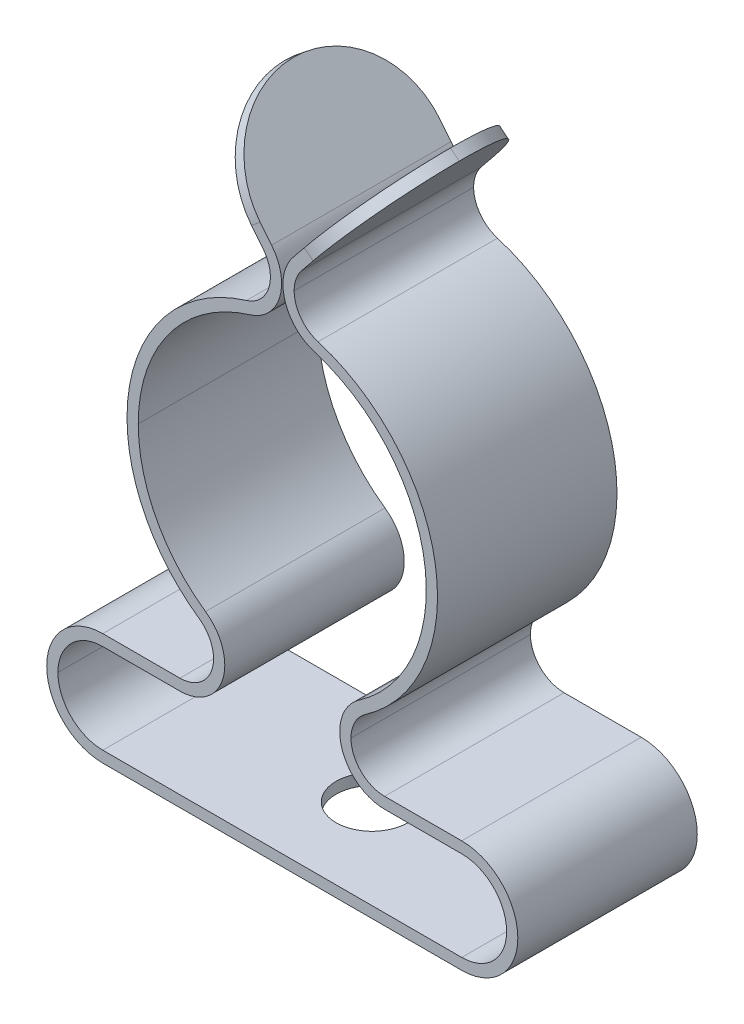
ISO-10303-21;
HEADER;
FILE_DESCRIPTION(('STEP AP214'),'2;1');
FILE_NAME('part.step','',(''),(''),'','','');
FILE_SCHEMA(('AUTOMOTIVE_DESIGN { 1 0 10303 214 1 1 1 1 }'));
ENDSEC;
DATA;
#1=APPLICATION_CONTEXT('core data for automotive mechanical design processes');
#2=APPLICATION_PROTOCOL_DEFINITION('international standard','automotive_design',2000,#1);
#3=PRODUCT_CONTEXT('',#1,'mechanical');
#4=PRODUCT('Part','Part','',(#3));
#5=PRODUCT_RELATED_PRODUCT_CATEGORY('part','',(#4));
#6=PRODUCT_DEFINITION_FORMATION('','',#4);
#7=PRODUCT_DEFINITION_CONTEXT('part definition',#1,'design');
#8=PRODUCT_DEFINITION('design','',#6,#7);
#9=PRODUCT_DEFINITION_SHAPE('','',#8);
#10=(LENGTH_UNIT() NAMED_UNIT(*) SI_UNIT(.MILLI.,.METRE.));
#11=(NAMED_UNIT(*) PLANE_ANGLE_UNIT() SI_UNIT($,.RADIAN.));
#12=(NAMED_UNIT(*) SI_UNIT($,.STERADIAN.) SOLID_ANGLE_UNIT());
#13=UNCERTAINTY_MEASURE_WITH_UNIT(LENGTH_MEASURE(1.E-05),#10,'distance_accuracy_value','');
#14=(GEOMETRIC_REPRESENTATION_CONTEXT(3) GLOBAL_UNCERTAINTY_ASSIGNED_CONTEXT((#13)) GLOBAL_UNIT_ASSIGNED_CONTEXT((#10,
#11,#12)) REPRESENTATION_CONTEXT('',''));
#15=CARTESIAN_POINT('',(0.,0.,0.));
#16=DIRECTION('',(0.,0.,1.));
#17=DIRECTION('',(1.,0.,0.));
#18=AXIS2_PLACEMENT_3D('',#15,#16,#17);
#19=CARTESIAN_POINT('',(2.54032362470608,22.6320461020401,0.));
#20=DIRECTION('',(0.77762314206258,-0.628730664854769,0.));
#21=DIRECTION('',(0.628730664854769,0.777623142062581,0.));
#22=AXIS2_PLACEMENT_3D('',#19,#20,#21);
#23=CYLINDRICAL_SURFACE('',#22,4.);
#24=CARTESIAN_POINT('',(0.985077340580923,23.8895074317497,0.));
#25=DIRECTION('',(-0.77762314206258,0.628730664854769,0.));
#26=DIRECTION('',(-0.628730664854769,-0.77762314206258,0.));
#27=AXIS2_PLACEMENT_3D('',#24,#25,#26);
#28=CIRCLE('',#27,4.);
#29=CARTESIAN_POINT('',(3.5,27.,0.));
#30=VERTEX_POINT('',#29);
#31=CARTESIAN_POINT('',(0.985077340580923,23.8895074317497,-4.));
#32=VERTEX_POINT('',#31);
#33=EDGE_CURVE('E482',#30,#32,#28,.T.);
#34=ORIENTED_EDGE('',*,*,#33,.F.);
#35=DIRECTION('',(0.777623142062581,-0.628730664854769,0.));
#36=VECTOR('',#35,1.);
#37=CARTESIAN_POINT('',(3.88881157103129,26.6856346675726,0.));
#38=LINE('',#37,#36);
#39=CARTESIAN_POINT('',(3.88881157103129,26.6856346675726,0.));
#40=VERTEX_POINT('',#39);
#41=EDGE_CURVE('E9',#30,#40,#38,.T.);
#42=ORIENTED_EDGE('',*,*,#41,.T.);
#43=CARTESIAN_POINT('',(1.37388891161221,23.5751420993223,0.));
#44=DIRECTION('',(0.77762314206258,-0.628730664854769,0.));
#45=DIRECTION('',(-0.628730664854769,-0.77762314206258,0.));
#46=AXIS2_PLACEMENT_3D('',#43,#44,#45);
#47=CIRCLE('',#46,4.);
#48=CARTESIAN_POINT('',(1.37388891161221,23.5751420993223,-4.));
#49=VERTEX_POINT('',#48);
#50=EDGE_CURVE('E467',#49,#40,#47,.T.);
#51=ORIENTED_EDGE('',*,*,#50,.F.);
#52=DIRECTION('',(0.777623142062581,-0.628730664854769,0.));
#53=VECTOR('',#52,1.);
#54=CARTESIAN_POINT('',(2.54032362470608,22.6320461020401,-4.));
#55=LINE('',#54,#53);
#56=EDGE_CURVE('E242',#32,#49,#55,.T.);
#57=ORIENTED_EDGE('',*,*,#56,.F.);
#58=EDGE_LOOP('',(#34,#42,#51,#57));
#59=FACE_BOUND('',#58,.T.);
#60=ADVANCED_FACE('F15',(#59),#23,.T.);
#61=CARTESIAN_POINT('',(0.985077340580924,23.8895074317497,0.));
#62=DIRECTION('',(-0.77762314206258,0.628730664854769,0.));
#63=DIRECTION('',(-0.628730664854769,-0.777623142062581,0.));
#64=AXIS2_PLACEMENT_3D('',#61,#62,#63);
#65=CYLINDRICAL_SURFACE('',#64,4.);
#66=ORIENTED_EDGE('',*,*,#41,.F.);
#67=CARTESIAN_POINT('',(0.985077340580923,23.8895074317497,0.));
#68=DIRECTION('',(-0.77762314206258,0.628730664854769,0.));
#69=DIRECTION('',(-0.628730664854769,-0.77762314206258,0.));
#70=AXIS2_PLACEMENT_3D('',#67,#68,#69);
#71=CIRCLE('',#70,4.);
#72=CARTESIAN_POINT('',(0.985077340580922,23.8895074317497,4.));
#73=VERTEX_POINT('',#72);
#74=EDGE_CURVE('E478',#73,#30,#71,.T.);
#75=ORIENTED_EDGE('',*,*,#74,.F.);
#76=DIRECTION('',(-0.777623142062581,0.628730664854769,0.));
#77=VECTOR('',#76,1.);
#78=CARTESIAN_POINT('',(0.985077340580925,23.8895074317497,4.));
#79=LINE('',#78,#77);
#80=CARTESIAN_POINT('',(1.37388891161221,23.5751420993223,4.));
#81=VERTEX_POINT('',#80);
#82=EDGE_CURVE('E153',#81,#73,#79,.T.);
#83=ORIENTED_EDGE('',*,*,#82,.F.);
#84=CARTESIAN_POINT('',(1.37388891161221,23.5751420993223,0.));
#85=DIRECTION('',(0.77762314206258,-0.628730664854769,0.));
#86=DIRECTION('',(-0.628730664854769,-0.77762314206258,0.));
#87=AXIS2_PLACEMENT_3D('',#84,#85,#86);
#88=CIRCLE('',#87,4.);
#89=EDGE_CURVE('E471',#40,#81,#88,.T.);
#90=ORIENTED_EDGE('',*,*,#89,.F.);
#91=EDGE_LOOP('',(#66,#75,#83,#90));
#92=FACE_BOUND('',#91,.T.);
#93=ADVANCED_FACE('F757',(#92),#65,.T.);
#94=CARTESIAN_POINT('',(-0.0861019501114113,24.6163548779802,0.));
#95=DIRECTION('',(0.77762314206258,0.628730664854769,0.));
#96=DIRECTION('',(-0.628730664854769,0.777623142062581,0.));
#97=AXIS2_PLACEMENT_3D('',#94,#95,#96);
#98=CYLINDRICAL_SURFACE('',#97,4.);
#99=CARTESIAN_POINT('',(-1.37388891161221,23.5751420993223,0.));
#100=DIRECTION('',(-0.77762314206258,-0.628730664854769,0.));
#101=DIRECTION('',(-0.628730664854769,0.77762314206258,0.));
#102=AXIS2_PLACEMENT_3D('',#99,#100,#101);
#103=CIRCLE('',#102,4.);
#104=CARTESIAN_POINT('',(-3.88881157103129,26.6856346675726,0.));
#105=VERTEX_POINT('',#104);
#106=CARTESIAN_POINT('',(-1.37388891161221,23.5751420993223,-4.));
#107=VERTEX_POINT('',#106);
#108=EDGE_CURVE('E186',#105,#107,#103,.T.);
#109=ORIENTED_EDGE('',*,*,#108,.F.);
#110=DIRECTION('',(0.777623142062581,0.628730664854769,0.));
#111=VECTOR('',#110,1.);
#112=CARTESIAN_POINT('',(-3.5,27.,0.));
#113=LINE('',#112,#111);
#114=CARTESIAN_POINT('',(-3.5,27.,0.));
#115=VERTEX_POINT('',#114);
#116=EDGE_CURVE('E23',#105,#115,#113,.T.);
#117=ORIENTED_EDGE('',*,*,#116,.T.);
#118=CARTESIAN_POINT('',(-0.985077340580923,23.8895074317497,0.));
#119=DIRECTION('',(0.77762314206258,0.628730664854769,0.));
#120=DIRECTION('',(-0.628730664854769,0.77762314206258,0.));
#121=AXIS2_PLACEMENT_3D('',#118,#119,#120);
#122=CIRCLE('',#121,4.);
#123=CARTESIAN_POINT('',(-0.985077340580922,23.8895074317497,-4.));
#124=VERTEX_POINT('',#123);
#125=EDGE_CURVE('E168',#124,#115,#122,.T.);
#126=ORIENTED_EDGE('',*,*,#125,.F.);
#127=DIRECTION('',(0.777623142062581,0.628730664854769,0.));
#128=VECTOR('',#127,1.);
#129=CARTESIAN_POINT('',(-0.0861019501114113,24.6163548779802,-4.));
#130=LINE('',#129,#128);
#131=EDGE_CURVE('E240',#107,#124,#130,.T.);
#132=ORIENTED_EDGE('',*,*,#131,.F.);
#133=EDGE_LOOP('',(#109,#117,#126,#132));
#134=FACE_BOUND('',#133,.T.);
#135=ADVANCED_FACE('F762',(#134),#98,.T.);
#136=CARTESIAN_POINT('',(-1.37388891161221,23.5751420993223,0.));
#137=DIRECTION('',(-0.77762314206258,-0.628730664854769,0.));
#138=DIRECTION('',(0.628730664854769,-0.777623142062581,0.));
#139=AXIS2_PLACEMENT_3D('',#136,#137,#138);
#140=CYLINDRICAL_SURFACE('',#139,4.);
#141=ORIENTED_EDGE('',*,*,#116,.F.);
#142=CARTESIAN_POINT('',(-1.37388891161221,23.5751420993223,0.));
#143=DIRECTION('',(-0.77762314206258,-0.628730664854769,0.));
#144=DIRECTION('',(-0.628730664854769,0.77762314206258,0.));
#145=AXIS2_PLACEMENT_3D('',#142,#143,#144);
#146=CIRCLE('',#145,4.);
#147=CARTESIAN_POINT('',(-1.37388891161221,23.5751420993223,4.));
#148=VERTEX_POINT('',#147);
#149=EDGE_CURVE('E148',#148,#105,#146,.T.);
#150=ORIENTED_EDGE('',*,*,#149,.F.);
#151=DIRECTION('',(-0.777623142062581,-0.628730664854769,0.));
#152=VECTOR('',#151,1.);
#153=CARTESIAN_POINT('',(-1.37388891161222,23.5751420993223,4.));
#154=LINE('',#153,#152);
#155=CARTESIAN_POINT('',(-0.985077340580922,23.8895074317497,4.));
#156=VERTEX_POINT('',#155);
#157=EDGE_CURVE('E141',#156,#148,#154,.T.);
#158=ORIENTED_EDGE('',*,*,#157,.F.);
#159=CARTESIAN_POINT('',(-0.985077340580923,23.8895074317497,0.));
#160=DIRECTION('',(0.77762314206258,0.628730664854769,0.));
#161=DIRECTION('',(-0.628730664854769,0.77762314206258,0.));
#162=AXIS2_PLACEMENT_3D('',#159,#160,#161);
#163=CIRCLE('',#162,4.);
#164=EDGE_CURVE('E145',#115,#156,#163,.T.);
#165=ORIENTED_EDGE('',*,*,#164,.F.);
#166=EDGE_LOOP('',(#141,#150,#158,#165));
#167=FACE_BOUND('',#166,.T.);
#168=ADVANCED_FACE('F143',(#167),#140,.T.);
#169=CARTESIAN_POINT('',(0.,4.5254833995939,0.));
#170=DIRECTION('',(0.,-1.,0.));
#171=DIRECTION('',(0.,0.,-1.));
#172=AXIS2_PLACEMENT_3D('',#169,#170,#171);
#173=CYLINDRICAL_SURFACE('',#172,1.6);
#174=DIRECTION('',(0.,-1.,0.));
#175=VECTOR('',#174,1.);
#176=CARTESIAN_POINT('',(0.,4.5254833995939,1.6));
#177=LINE('',#176,#175);
#178=CARTESIAN_POINT('',(0.,0.,1.6));
#179=VERTEX_POINT('',#178);
#180=CARTESIAN_POINT('',(0.,-0.5,1.6));
#181=VERTEX_POINT('',#180);
#182=EDGE_CURVE('E898',#179,#181,#177,.T.);
#183=ORIENTED_EDGE('',*,*,#182,.F.);
#184=CARTESIAN_POINT('',(0.,0.,0.));
#185=DIRECTION('',(0.,-1.,0.));
#186=DIRECTION('',(0.,0.,1.));
#187=AXIS2_PLACEMENT_3D('',#184,#185,#186);
#188=CIRCLE('',#187,1.6);
#189=CARTESIAN_POINT('',(0.,0.,-1.6));
#190=VERTEX_POINT('',#189);
#191=EDGE_CURVE('E274',#190,#179,#188,.T.);
#192=ORIENTED_EDGE('',*,*,#191,.F.);
#193=DIRECTION('',(0.,-1.,0.));
#194=VECTOR('',#193,1.);
#195=CARTESIAN_POINT('',(0.,4.5254833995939,-1.6));
#196=LINE('',#195,#194);
#197=CARTESIAN_POINT('',(0.,-0.5,-1.6));
#198=VERTEX_POINT('',#197);
#199=EDGE_CURVE('E817',#190,#198,#196,.T.);
#200=ORIENTED_EDGE('',*,*,#199,.T.);
#201=CARTESIAN_POINT('',(0.,-0.5,0.));
#202=DIRECTION('',(0.,-1.,0.));
#203=DIRECTION('',(0.,0.,-1.));
#204=AXIS2_PLACEMENT_3D('',#201,#202,#203);
#205=CIRCLE('',#204,1.6);
#206=EDGE_CURVE('E216',#198,#181,#205,.T.);
#207=ORIENTED_EDGE('',*,*,#206,.T.);
#208=EDGE_LOOP('',(#183,#192,#200,#207));
#209=FACE_BOUND('',#208,.T.);
#210=ADVANCED_FACE('F955',(#209),#173,.F.);
#211=CARTESIAN_POINT('',(2.02929618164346,22.,-4.));
#212=DIRECTION('',(0.,0.,-1.));
#213=DIRECTION('',(0.,-1.,0.));
#214=AXIS2_PLACEMENT_3D('',#211,#212,#213);
#215=PLANE('',#214);
#216=DIRECTION('',(0.62873066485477,-0.77762314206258,0.));
#217=VECTOR('',#216,1.);
#218=CARTESIAN_POINT('',(-0.862861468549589,22.9430959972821,-4.));
#219=LINE('',#218,#217);
#220=CARTESIAN_POINT('',(-0.862861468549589,22.9430959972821,-4.));
#221=VERTEX_POINT('',#220);
#222=EDGE_CURVE('E187',#107,#221,#219,.T.);
#223=ORIENTED_EDGE('',*,*,#222,.F.);
#224=ORIENTED_EDGE('',*,*,#131,.T.);
#225=DIRECTION('',(0.628730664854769,-0.77762314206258,0.));
#226=VECTOR('',#225,1.);
#227=CARTESIAN_POINT('',(-0.474049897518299,23.2574613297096,-4.));
#228=LINE('',#227,#226);
#229=CARTESIAN_POINT('',(-0.474049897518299,23.2574613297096,-4.));
#230=VERTEX_POINT('',#229);
#231=EDGE_CURVE('E175',#124,#230,#228,.T.);
#232=ORIENTED_EDGE('',*,*,#231,.T.);
#233=CARTESIAN_POINT('',(-2.02929618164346,22.,-4.));
#234=DIRECTION('',(0.,0.,-1.));
#235=DIRECTION('',(1.,0.,0.));
#236=AXIS2_PLACEMENT_3D('',#233,#234,#235);
#237=CIRCLE('',#236,2.);
#238=CARTESIAN_POINT('',(-1.44956711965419,20.08586463,-4.));
#239=VERTEX_POINT('',#238);
#240=EDGE_CURVE('E331',#230,#239,#237,.T.);
#241=ORIENTED_EDGE('',*,*,#240,.T.);
#242=CARTESIAN_POINT('',(0.57948459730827,13.386390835,-4.));
#243=DIRECTION('',(0.,0.,1.));
#244=DIRECTION('',(-1.,0.,0.));
#245=AXIS2_PLACEMENT_3D('',#242,#243,#244);
#246=CIRCLE('',#245,7.);
#247=CARTESIAN_POINT('',(-6.42051540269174,13.386390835,-4.));
#248=VERTEX_POINT('',#247);
#249=EDGE_CURVE('E392',#239,#248,#246,.T.);
#250=ORIENTED_EDGE('',*,*,#249,.T.);
#251=CARTESIAN_POINT('',(0.57948459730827,13.386390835,-4.));
#252=DIRECTION('',(0.,0.,1.));
#253=DIRECTION('',(-1.,0.,0.));
#254=AXIS2_PLACEMENT_3D('',#251,#252,#253);
#255=CIRCLE('',#254,7.);
#256=CARTESIAN_POINT('',(-3.41992938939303,7.64142018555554,-4.));
#257=VERTEX_POINT('',#256);
#258=EDGE_CURVE('E327',#248,#257,#255,.T.);
#259=ORIENTED_EDGE('',*,*,#258,.T.);
#260=CARTESIAN_POINT('',(-4.56261909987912,6.,-4.));
#261=DIRECTION('',(0.,0.,-1.));
#262=DIRECTION('',(1.,0.,0.));
#263=AXIS2_PLACEMENT_3D('',#260,#261,#262);
#264=CIRCLE('',#263,2.);
#265=CARTESIAN_POINT('',(-4.56261909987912,4.,-4.));
#266=VERTEX_POINT('',#265);
#267=EDGE_CURVE('E307',#257,#266,#264,.T.);
#268=ORIENTED_EDGE('',*,*,#267,.T.);
#269=DIRECTION('',(-1.,0.,0.));
#270=VECTOR('',#269,1.);
#271=CARTESIAN_POINT('',(-8.,4.,-4.));
#272=LINE('',#271,#270);
#273=CARTESIAN_POINT('',(-8.,4.,-4.));
#274=VERTEX_POINT('',#273);
#275=EDGE_CURVE('E290',#266,#274,#272,.T.);
#276=ORIENTED_EDGE('',*,*,#275,.T.);
#277=CARTESIAN_POINT('',(-8.,2.,-4.));
#278=DIRECTION('',(0.,0.,1.));
#279=DIRECTION('',(-1.,0.,0.));
#280=AXIS2_PLACEMENT_3D('',#277,#278,#279);
#281=CIRCLE('',#280,2.);
#282=CARTESIAN_POINT('',(-10.,2.,-4.));
#283=VERTEX_POINT('',#282);
#284=EDGE_CURVE('E413',#274,#283,#281,.T.);
#285=ORIENTED_EDGE('',*,*,#284,.T.);
#286=CARTESIAN_POINT('',(-8.,2.,-4.));
#287=DIRECTION('',(0.,0.,1.));
#288=DIRECTION('',(-1.,0.,0.));
#289=AXIS2_PLACEMENT_3D('',#286,#287,#288);
#290=CIRCLE('',#289,2.);
#291=CARTESIAN_POINT('',(-8.,0.,-4.));
#292=VERTEX_POINT('',#291);
#293=EDGE_CURVE('E285',#283,#292,#290,.T.);
#294=ORIENTED_EDGE('',*,*,#293,.T.);
#295=DIRECTION('',(1.,0.,0.));
#296=VECTOR('',#295,1.);
#297=CARTESIAN_POINT('',(-8.,0.,-4.));
#298=LINE('',#297,#296);
#299=CARTESIAN_POINT('',(8.,0.,-4.));
#300=VERTEX_POINT('',#299);
#301=EDGE_CURVE('E263',#292,#300,#298,.T.);
#302=ORIENTED_EDGE('',*,*,#301,.T.);
#303=CARTESIAN_POINT('',(8.,2.,-4.));
#304=DIRECTION('',(0.,0.,1.));
#305=DIRECTION('',(1.,0.,0.));
#306=AXIS2_PLACEMENT_3D('',#303,#304,#305);
#307=CIRCLE('',#306,2.);
#308=CARTESIAN_POINT('',(8.,4.,-4.));
#309=VERTEX_POINT('',#308);
#310=EDGE_CURVE('E529',#300,#309,#307,.T.);
#311=ORIENTED_EDGE('',*,*,#310,.T.);
#312=DIRECTION('',(-1.,0.,0.));
#313=VECTOR('',#312,1.);
#314=CARTESIAN_POINT('',(8.,4.,-4.));
#315=LINE('',#314,#313);
#316=CARTESIAN_POINT('',(4.56261909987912,4.,-4.));
#317=VERTEX_POINT('',#316);
#318=EDGE_CURVE('E517',#309,#317,#315,.T.);
#319=ORIENTED_EDGE('',*,*,#318,.T.);
#320=CARTESIAN_POINT('',(4.56261909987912,6.,-4.));
#321=DIRECTION('',(0.,0.,-1.));
#322=DIRECTION('',(-1.,0.,0.));
#323=AXIS2_PLACEMENT_3D('',#320,#321,#322);
#324=CIRCLE('',#323,2.);
#325=CARTESIAN_POINT('',(2.56261909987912,6.,-4.));
#326=VERTEX_POINT('',#325);
#327=EDGE_CURVE('E436',#317,#326,#324,.T.);
#328=ORIENTED_EDGE('',*,*,#327,.T.);
#329=CARTESIAN_POINT('',(4.56261909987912,6.,-4.));
#330=DIRECTION('',(0.,0.,-1.));
#331=DIRECTION('',(-1.,0.,0.));
#332=AXIS2_PLACEMENT_3D('',#329,#330,#331);
#333=CIRCLE('',#332,2.);
#334=CARTESIAN_POINT('',(3.41992938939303,7.64142018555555,-4.));
#335=VERTEX_POINT('',#334);
#336=EDGE_CURVE('E513',#326,#335,#333,.T.);
#337=ORIENTED_EDGE('',*,*,#336,.T.);
#338=CARTESIAN_POINT('',(-0.57948459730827,13.386390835,-4.));
#339=DIRECTION('',(0.,0.,1.));
#340=DIRECTION('',(1.,0.,0.));
#341=AXIS2_PLACEMENT_3D('',#338,#339,#340);
#342=CIRCLE('',#341,7.);
#343=CARTESIAN_POINT('',(1.44956711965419,20.08586463,-4.));
#344=VERTEX_POINT('',#343);
#345=EDGE_CURVE('E359',#335,#344,#342,.T.);
#346=ORIENTED_EDGE('',*,*,#345,.T.);
#347=CARTESIAN_POINT('',(2.02929618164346,22.,-4.));
#348=DIRECTION('',(0.,0.,-1.));
#349=DIRECTION('',(-1.,0.,0.));
#350=AXIS2_PLACEMENT_3D('',#347,#348,#349);
#351=CIRCLE('',#350,2.);
#352=CARTESIAN_POINT('',(0.0292961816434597,22.,-4.));
#353=VERTEX_POINT('',#352);
#354=EDGE_CURVE('E455',#344,#353,#351,.T.);
#355=ORIENTED_EDGE('',*,*,#354,.T.);
#356=CARTESIAN_POINT('',(2.02929618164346,22.,-4.));
#357=DIRECTION('',(0.,0.,-1.));
#358=DIRECTION('',(-1.,0.,0.));
#359=AXIS2_PLACEMENT_3D('',#356,#357,#358);
#360=CIRCLE('',#359,2.);
#361=CARTESIAN_POINT('',(0.4740498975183,23.2574613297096,-4.));
#362=VERTEX_POINT('',#361);
#363=EDGE_CURVE('E364',#353,#362,#360,.T.);
#364=ORIENTED_EDGE('',*,*,#363,.T.);
#365=DIRECTION('',(0.628730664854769,0.77762314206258,0.));
#366=VECTOR('',#365,1.);
#367=CARTESIAN_POINT('',(0.474049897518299,23.2574613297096,-4.));
#368=LINE('',#367,#366);
#369=EDGE_CURVE('E488',#362,#32,#368,.T.);
#370=ORIENTED_EDGE('',*,*,#369,.T.);
#371=ORIENTED_EDGE('',*,*,#56,.T.);
#372=DIRECTION('',(0.62873066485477,0.77762314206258,0.));
#373=VECTOR('',#372,1.);
#374=CARTESIAN_POINT('',(0.862861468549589,22.9430959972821,-4.));
#375=LINE('',#374,#373);
#376=CARTESIAN_POINT('',(0.862861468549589,22.9430959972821,-4.));
#377=VERTEX_POINT('',#376);
#378=EDGE_CURVE('E463',#377,#49,#375,.T.);
#379=ORIENTED_EDGE('',*,*,#378,.F.);
#380=CARTESIAN_POINT('',(2.02929618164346,22.,-4.));
#381=DIRECTION('',(0.,0.,-1.));
#382=DIRECTION('',(1.,0.,0.));
#383=AXIS2_PLACEMENT_3D('',#380,#381,#382);
#384=CIRCLE('',#383,1.5);
#385=CARTESIAN_POINT('',(0.52929618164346,22.,-4.));
#386=VERTEX_POINT('',#385);
#387=EDGE_CURVE('E779',#386,#377,#384,.T.);
#388=ORIENTED_EDGE('',*,*,#387,.F.);
#389=CARTESIAN_POINT('',(2.02929618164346,22.,-4.));
#390=DIRECTION('',(0.,0.,-1.));
#391=DIRECTION('',(1.,0.,0.));
#392=AXIS2_PLACEMENT_3D('',#389,#390,#391);
#393=CIRCLE('',#392,1.5);
#394=CARTESIAN_POINT('',(1.59449938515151,20.5643984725,-4.));
#395=VERTEX_POINT('',#394);
#396=EDGE_CURVE('E47',#395,#386,#393,.T.);
#397=ORIENTED_EDGE('',*,*,#396,.F.);
#398=CARTESIAN_POINT('',(-0.57948459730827,13.386390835,-4.));
#399=DIRECTION('',(0.,0.,1.));
#400=DIRECTION('',(1.,0.,0.));
#401=AXIS2_PLACEMENT_3D('',#398,#399,#400);
#402=CIRCLE('',#401,7.5);
#403=CARTESIAN_POINT('',(3.70560181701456,7.23106513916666,-4.));
#404=VERTEX_POINT('',#403);
#405=EDGE_CURVE('E180',#404,#395,#402,.T.);
#406=ORIENTED_EDGE('',*,*,#405,.F.);
#407=CARTESIAN_POINT('',(4.56261909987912,6.,-4.));
#408=DIRECTION('',(0.,0.,-1.));
#409=DIRECTION('',(1.,0.,0.));
#410=AXIS2_PLACEMENT_3D('',#407,#408,#409);
#411=CIRCLE('',#410,1.5);
#412=CARTESIAN_POINT('',(3.06261909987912,6.,-4.));
#413=VERTEX_POINT('',#412);
#414=EDGE_CURVE('E854',#413,#404,#411,.T.);
#415=ORIENTED_EDGE('',*,*,#414,.F.);
#416=CARTESIAN_POINT('',(4.56261909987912,6.,-4.));
#417=DIRECTION('',(0.,0.,-1.));
#418=DIRECTION('',(1.,0.,0.));
#419=AXIS2_PLACEMENT_3D('',#416,#417,#418);
#420=CIRCLE('',#419,1.5);
#421=CARTESIAN_POINT('',(4.56261909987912,4.5,-4.));
#422=VERTEX_POINT('',#421);
#423=EDGE_CURVE('E100',#422,#413,#420,.T.);
#424=ORIENTED_EDGE('',*,*,#423,.F.);
#425=DIRECTION('',(-1.,0.,0.));
#426=VECTOR('',#425,1.);
#427=CARTESIAN_POINT('',(8.,4.5,-4.));
#428=LINE('',#427,#426);
#429=CARTESIAN_POINT('',(8.,4.5,-4.));
#430=VERTEX_POINT('',#429);
#431=EDGE_CURVE('E226',#430,#422,#428,.T.);
#432=ORIENTED_EDGE('',*,*,#431,.F.);
#433=CARTESIAN_POINT('',(8.,2.,-4.));
#434=DIRECTION('',(0.,0.,1.));
#435=DIRECTION('',(1.,0.,0.));
#436=AXIS2_PLACEMENT_3D('',#433,#434,#435);
#437=CIRCLE('',#436,2.5);
#438=CARTESIAN_POINT('',(8.,-0.5,-4.));
#439=VERTEX_POINT('',#438);
#440=EDGE_CURVE('E220',#439,#430,#437,.T.);
#441=ORIENTED_EDGE('',*,*,#440,.F.);
#442=DIRECTION('',(1.,0.,0.));
#443=VECTOR('',#442,1.);
#444=CARTESIAN_POINT('',(-8.,-0.5,-4.));
#445=LINE('',#444,#443);
#446=CARTESIAN_POINT('',(-8.,-0.5,-4.));
#447=VERTEX_POINT('',#446);
#448=EDGE_CURVE('E303',#447,#439,#445,.T.);
#449=ORIENTED_EDGE('',*,*,#448,.F.);
#450=CARTESIAN_POINT('',(-8.,2.,-4.));
#451=DIRECTION('',(0.,0.,1.));
#452=DIRECTION('',(1.,0.,0.));
#453=AXIS2_PLACEMENT_3D('',#450,#451,#452);
#454=CIRCLE('',#453,2.5);
#455=CARTESIAN_POINT('',(-10.5,2.,-4.));
#456=VERTEX_POINT('',#455);
#457=EDGE_CURVE('E835',#456,#447,#454,.T.);
#458=ORIENTED_EDGE('',*,*,#457,.F.);
#459=CARTESIAN_POINT('',(-8.,2.,-4.));
#460=DIRECTION('',(0.,0.,1.));
#461=DIRECTION('',(1.,0.,0.));
#462=AXIS2_PLACEMENT_3D('',#459,#460,#461);
#463=CIRCLE('',#462,2.5);
#464=CARTESIAN_POINT('',(-8.,4.5,-4.));
#465=VERTEX_POINT('',#464);
#466=EDGE_CURVE('E299',#465,#456,#463,.T.);
#467=ORIENTED_EDGE('',*,*,#466,.F.);
#468=DIRECTION('',(-1.,0.,0.));
#469=VECTOR('',#468,1.);
#470=CARTESIAN_POINT('',(-8.,4.5,-4.));
#471=LINE('',#470,#469);
#472=CARTESIAN_POINT('',(-4.56261909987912,4.5,-4.));
#473=VERTEX_POINT('',#472);
#474=EDGE_CURVE('E210',#473,#465,#471,.T.);
#475=ORIENTED_EDGE('',*,*,#474,.F.);
#476=CARTESIAN_POINT('',(-4.56261909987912,6.,-4.));
#477=DIRECTION('',(0.,0.,-1.));
#478=DIRECTION('',(1.,0.,0.));
#479=AXIS2_PLACEMENT_3D('',#476,#477,#478);
#480=CIRCLE('',#479,1.5);
#481=CARTESIAN_POINT('',(-3.70560181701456,7.23106513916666,-4.));
#482=VERTEX_POINT('',#481);
#483=EDGE_CURVE('E201',#482,#473,#480,.T.);
#484=ORIENTED_EDGE('',*,*,#483,.F.);
#485=CARTESIAN_POINT('',(0.57948459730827,13.386390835,-4.));
#486=DIRECTION('',(0.,0.,1.));
#487=DIRECTION('',(1.,0.,0.));
#488=AXIS2_PLACEMENT_3D('',#485,#486,#487);
#489=CIRCLE('',#488,7.5);
#490=CARTESIAN_POINT('',(-6.92051540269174,13.386390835,-4.));
#491=VERTEX_POINT('',#490);
#492=EDGE_CURVE('E358',#491,#482,#489,.T.);
#493=ORIENTED_EDGE('',*,*,#492,.F.);
#494=CARTESIAN_POINT('',(0.57948459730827,13.386390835,-4.));
#495=DIRECTION('',(0.,0.,1.));
#496=DIRECTION('',(1.,0.,0.));
#497=AXIS2_PLACEMENT_3D('',#494,#495,#496);
#498=CIRCLE('',#497,7.5);
#499=CARTESIAN_POINT('',(-1.59449938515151,20.5643984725,-4.));
#500=VERTEX_POINT('',#499);
#501=EDGE_CURVE('E196',#500,#491,#498,.T.);
#502=ORIENTED_EDGE('',*,*,#501,.F.);
#503=CARTESIAN_POINT('',(-2.02929618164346,22.,-4.));
#504=DIRECTION('',(0.,0.,-1.));
#505=DIRECTION('',(1.,0.,0.));
#506=AXIS2_PLACEMENT_3D('',#503,#504,#505);
#507=CIRCLE('',#506,1.5);
#508=EDGE_CURVE('E395',#221,#500,#507,.T.);
#509=ORIENTED_EDGE('',*,*,#508,.F.);
#510=EDGE_LOOP('',(#223,#224,#232,#241,#250,#259,#268,#276,#285,#294,#302,#311,#319,#328,#337,
#346,#355,#364,#370,#371,#379,#388,#397,#406,#415,#424,#432,#441,#449,#458,#467,#475,#484,#493,
#502,#509));
#511=FACE_BOUND('',#510,.T.);
#512=ADVANCED_FACE('F566',(#511),#215,.T.);
#513=CARTESIAN_POINT('',(2.02929618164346,22.,4.));
#514=DIRECTION('',(0.,0.,-1.));
#515=DIRECTION('',(0.,-1.,0.));
#516=AXIS2_PLACEMENT_3D('',#513,#514,#515);
#517=PLANE('',#516);
#518=DIRECTION('',(0.628730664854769,-0.77762314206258,0.));
#519=VECTOR('',#518,1.);
#520=CARTESIAN_POINT('',(-0.474049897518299,23.2574613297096,4.));
#521=LINE('',#520,#519);
#522=CARTESIAN_POINT('',(-0.474049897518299,23.2574613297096,4.));
#523=VERTEX_POINT('',#522);
#524=EDGE_CURVE('E156',#156,#523,#521,.T.);
#525=ORIENTED_EDGE('',*,*,#524,.F.);
#526=ORIENTED_EDGE('',*,*,#157,.T.);
#527=DIRECTION('',(0.62873066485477,-0.77762314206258,0.));
#528=VECTOR('',#527,1.);
#529=CARTESIAN_POINT('',(-0.862861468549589,22.9430959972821,4.));
#530=LINE('',#529,#528);
#531=CARTESIAN_POINT('',(-0.862861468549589,22.9430959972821,4.));
#532=VERTEX_POINT('',#531);
#533=EDGE_CURVE('E388',#148,#532,#530,.T.);
#534=ORIENTED_EDGE('',*,*,#533,.T.);
#535=CARTESIAN_POINT('',(-2.02929618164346,22.,4.));
#536=DIRECTION('',(0.,0.,-1.));
#537=DIRECTION('',(1.,0.,0.));
#538=AXIS2_PLACEMENT_3D('',#535,#536,#537);
#539=CIRCLE('',#538,1.5);
#540=CARTESIAN_POINT('',(-1.59449938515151,20.5643984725,4.));
#541=VERTEX_POINT('',#540);
#542=EDGE_CURVE('E197',#532,#541,#539,.T.);
#543=ORIENTED_EDGE('',*,*,#542,.T.);
#544=CARTESIAN_POINT('',(0.57948459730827,13.386390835,4.));
#545=DIRECTION('',(0.,0.,1.));
#546=DIRECTION('',(1.,0.,0.));
#547=AXIS2_PLACEMENT_3D('',#544,#545,#546);
#548=CIRCLE('',#547,7.5);
#549=CARTESIAN_POINT('',(-6.92051540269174,13.386390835,4.));
#550=VERTEX_POINT('',#549);
#551=EDGE_CURVE('E192',#541,#550,#548,.T.);
#552=ORIENTED_EDGE('',*,*,#551,.T.);
#553=CARTESIAN_POINT('',(0.57948459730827,13.386390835,4.));
#554=DIRECTION('',(0.,0.,1.));
#555=DIRECTION('',(1.,0.,0.));
#556=AXIS2_PLACEMENT_3D('',#553,#554,#555);
#557=CIRCLE('',#556,7.5);
#558=CARTESIAN_POINT('',(-3.70560181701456,7.23106513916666,4.));
#559=VERTEX_POINT('',#558);
#560=EDGE_CURVE('E351',#550,#559,#557,.T.);
#561=ORIENTED_EDGE('',*,*,#560,.T.);
#562=CARTESIAN_POINT('',(-4.56261909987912,6.,4.));
#563=DIRECTION('',(0.,0.,-1.));
#564=DIRECTION('',(1.,0.,0.));
#565=AXIS2_PLACEMENT_3D('',#562,#563,#564);
#566=CIRCLE('',#565,1.5);
#567=CARTESIAN_POINT('',(-4.56261909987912,4.5,4.));
#568=VERTEX_POINT('',#567);
#569=EDGE_CURVE('E206',#559,#568,#566,.T.);
#570=ORIENTED_EDGE('',*,*,#569,.T.);
#571=DIRECTION('',(-1.,0.,0.));
#572=VECTOR('',#571,1.);
#573=CARTESIAN_POINT('',(-8.,4.5,4.));
#574=LINE('',#573,#572);
#575=CARTESIAN_POINT('',(-8.,4.5,4.));
#576=VERTEX_POINT('',#575);
#577=EDGE_CURVE('E215',#568,#576,#574,.T.);
#578=ORIENTED_EDGE('',*,*,#577,.T.);
#579=CARTESIAN_POINT('',(-8.,2.,4.));
#580=DIRECTION('',(0.,0.,1.));
#581=DIRECTION('',(1.,0.,0.));
#582=AXIS2_PLACEMENT_3D('',#579,#580,#581);
#583=CIRCLE('',#582,2.5);
#584=CARTESIAN_POINT('',(-10.5,2.,4.));
#585=VERTEX_POINT('',#584);
#586=EDGE_CURVE('E289',#576,#585,#583,.T.);
#587=ORIENTED_EDGE('',*,*,#586,.T.);
#588=CARTESIAN_POINT('',(-8.,2.,4.));
#589=DIRECTION('',(0.,0.,1.));
#590=DIRECTION('',(1.,0.,0.));
#591=AXIS2_PLACEMENT_3D('',#588,#589,#590);
#592=CIRCLE('',#591,2.5);
#593=CARTESIAN_POINT('',(-8.,-0.5,4.));
#594=VERTEX_POINT('',#593);
#595=EDGE_CURVE('E828',#585,#594,#592,.T.);
#596=ORIENTED_EDGE('',*,*,#595,.T.);
#597=DIRECTION('',(1.,0.,0.));
#598=VECTOR('',#597,1.);
#599=CARTESIAN_POINT('',(-8.,-0.5,4.));
#600=LINE('',#599,#598);
#601=CARTESIAN_POINT('',(8.,-0.5,4.));
#602=VERTEX_POINT('',#601);
#603=EDGE_CURVE('E221',#594,#602,#600,.T.);
#604=ORIENTED_EDGE('',*,*,#603,.T.);
#605=CARTESIAN_POINT('',(8.,2.,4.));
#606=DIRECTION('',(0.,0.,1.));
#607=DIRECTION('',(1.,0.,0.));
#608=AXIS2_PLACEMENT_3D('',#605,#606,#607);
#609=CIRCLE('',#608,2.5);
#610=CARTESIAN_POINT('',(8.,4.5,4.));
#611=VERTEX_POINT('',#610);
#612=EDGE_CURVE('E231',#602,#611,#609,.T.);
#613=ORIENTED_EDGE('',*,*,#612,.T.);
#614=DIRECTION('',(-1.,0.,0.));
#615=VECTOR('',#614,1.);
#616=CARTESIAN_POINT('',(8.,4.5,4.));
#617=LINE('',#616,#615);
#618=CARTESIAN_POINT('',(4.56261909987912,4.5,4.));
#619=VERTEX_POINT('',#618);
#620=EDGE_CURVE('E112',#611,#619,#617,.T.);
#621=ORIENTED_EDGE('',*,*,#620,.T.);
#622=CARTESIAN_POINT('',(4.56261909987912,6.,4.));
#623=DIRECTION('',(0.,0.,-1.));
#624=DIRECTION('',(1.,0.,0.));
#625=AXIS2_PLACEMENT_3D('',#622,#623,#624);
#626=CIRCLE('',#625,1.5);
#627=CARTESIAN_POINT('',(3.06261909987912,6.,4.));
#628=VERTEX_POINT('',#627);
#629=EDGE_CURVE('E232',#619,#628,#626,.T.);
#630=ORIENTED_EDGE('',*,*,#629,.T.);
#631=CARTESIAN_POINT('',(4.56261909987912,6.,4.));
#632=DIRECTION('',(0.,0.,-1.));
#633=DIRECTION('',(1.,0.,0.));
#634=AXIS2_PLACEMENT_3D('',#631,#632,#633);
#635=CIRCLE('',#634,1.5);
#636=CARTESIAN_POINT('',(3.70560181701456,7.23106513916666,4.));
#637=VERTEX_POINT('',#636);
#638=EDGE_CURVE('E813',#628,#637,#635,.T.);
#639=ORIENTED_EDGE('',*,*,#638,.T.);
#640=CARTESIAN_POINT('',(-0.57948459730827,13.386390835,4.));
#641=DIRECTION('',(0.,0.,1.));
#642=DIRECTION('',(1.,0.,0.));
#643=AXIS2_PLACEMENT_3D('',#640,#641,#642);
#644=CIRCLE('',#643,7.5);
#645=CARTESIAN_POINT('',(1.59449938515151,20.5643984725,4.));
#646=VERTEX_POINT('',#645);
#647=EDGE_CURVE('E238',#637,#646,#644,.T.);
#648=ORIENTED_EDGE('',*,*,#647,.T.);
#649=CARTESIAN_POINT('',(2.02929618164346,22.,4.));
#650=DIRECTION('',(0.,0.,-1.));
#651=DIRECTION('',(1.,0.,0.));
#652=AXIS2_PLACEMENT_3D('',#649,#650,#651);
#653=CIRCLE('',#652,1.5);
#654=CARTESIAN_POINT('',(0.52929618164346,22.,4.));
#655=VERTEX_POINT('',#654);
#656=EDGE_CURVE('E34',#646,#655,#653,.T.);
#657=ORIENTED_EDGE('',*,*,#656,.T.);
#658=CARTESIAN_POINT('',(2.02929618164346,22.,4.));
#659=DIRECTION('',(0.,0.,-1.));
#660=DIRECTION('',(1.,0.,0.));
#661=AXIS2_PLACEMENT_3D('',#658,#659,#660);
#662=CIRCLE('',#661,1.5);
#663=CARTESIAN_POINT('',(0.862861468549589,22.9430959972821,4.));
#664=VERTEX_POINT('',#663);
#665=EDGE_CURVE('E811',#655,#664,#662,.T.);
#666=ORIENTED_EDGE('',*,*,#665,.T.);
#667=DIRECTION('',(0.62873066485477,0.77762314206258,0.));
#668=VECTOR('',#667,1.);
#669=CARTESIAN_POINT('',(0.862861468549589,22.9430959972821,4.));
#670=LINE('',#669,#668);
#671=EDGE_CURVE('E475',#664,#81,#670,.T.);
#672=ORIENTED_EDGE('',*,*,#671,.T.);
#673=ORIENTED_EDGE('',*,*,#82,.T.);
#674=DIRECTION('',(0.628730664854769,0.77762314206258,0.));
#675=VECTOR('',#674,1.);
#676=CARTESIAN_POINT('',(0.474049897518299,23.2574613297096,4.));
#677=LINE('',#676,#675);
#678=CARTESIAN_POINT('',(0.4740498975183,23.2574613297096,4.));
#679=VERTEX_POINT('',#678);
#680=EDGE_CURVE('E496',#679,#73,#677,.T.);
#681=ORIENTED_EDGE('',*,*,#680,.F.);
#682=CARTESIAN_POINT('',(2.02929618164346,22.,4.));
#683=DIRECTION('',(0.,0.,-1.));
#684=DIRECTION('',(-1.,0.,0.));
#685=AXIS2_PLACEMENT_3D('',#682,#683,#684);
#686=CIRCLE('',#685,2.);
#687=CARTESIAN_POINT('',(0.0292961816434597,22.,4.));
#688=VERTEX_POINT('',#687);
#689=EDGE_CURVE('E499',#688,#679,#686,.T.);
#690=ORIENTED_EDGE('',*,*,#689,.F.);
#691=CARTESIAN_POINT('',(2.02929618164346,22.,4.));
#692=DIRECTION('',(0.,0.,-1.));
#693=DIRECTION('',(-1.,0.,0.));
#694=AXIS2_PLACEMENT_3D('',#691,#692,#693);
#695=CIRCLE('',#694,2.);
#696=CARTESIAN_POINT('',(1.44956711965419,20.08586463,4.));
#697=VERTEX_POINT('',#696);
#698=EDGE_CURVE('E444',#697,#688,#695,.T.);
#699=ORIENTED_EDGE('',*,*,#698,.F.);
#700=CARTESIAN_POINT('',(-0.57948459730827,13.386390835,4.));
#701=DIRECTION('',(0.,0.,1.));
#702=DIRECTION('',(1.,0.,0.));
#703=AXIS2_PLACEMENT_3D('',#700,#701,#702);
#704=CIRCLE('',#703,7.);
#705=CARTESIAN_POINT('',(3.41992938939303,7.64142018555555,4.));
#706=VERTEX_POINT('',#705);
#707=EDGE_CURVE('E374',#706,#697,#704,.T.);
#708=ORIENTED_EDGE('',*,*,#707,.F.);
#709=CARTESIAN_POINT('',(4.56261909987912,6.,4.));
#710=DIRECTION('',(0.,0.,-1.));
#711=DIRECTION('',(-1.,0.,0.));
#712=AXIS2_PLACEMENT_3D('',#709,#710,#711);
#713=CIRCLE('',#712,2.);
#714=CARTESIAN_POINT('',(2.56261909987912,6.,4.));
#715=VERTEX_POINT('',#714);
#716=EDGE_CURVE('E509',#715,#706,#713,.T.);
#717=ORIENTED_EDGE('',*,*,#716,.F.);
#718=CARTESIAN_POINT('',(4.56261909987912,6.,4.));
#719=DIRECTION('',(0.,0.,-1.));
#720=DIRECTION('',(-1.,0.,0.));
#721=AXIS2_PLACEMENT_3D('',#718,#719,#720);
#722=CIRCLE('',#721,2.);
#723=CARTESIAN_POINT('',(4.56261909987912,4.,4.));
#724=VERTEX_POINT('',#723);
#725=EDGE_CURVE('E424',#724,#715,#722,.T.);
#726=ORIENTED_EDGE('',*,*,#725,.F.);
#727=DIRECTION('',(-1.,0.,0.));
#728=VECTOR('',#727,1.);
#729=CARTESIAN_POINT('',(8.,4.,4.));
#730=LINE('',#729,#728);
#731=CARTESIAN_POINT('',(8.,4.,4.));
#732=VERTEX_POINT('',#731);
#733=EDGE_CURVE('E525',#732,#724,#730,.T.);
#734=ORIENTED_EDGE('',*,*,#733,.F.);
#735=CARTESIAN_POINT('',(8.,2.,4.));
#736=DIRECTION('',(0.,0.,1.));
#737=DIRECTION('',(1.,0.,0.));
#738=AXIS2_PLACEMENT_3D('',#735,#736,#737);
#739=CIRCLE('',#738,2.);
#740=CARTESIAN_POINT('',(8.,0.,4.));
#741=VERTEX_POINT('',#740);
#742=EDGE_CURVE('E261',#741,#732,#739,.T.);
#743=ORIENTED_EDGE('',*,*,#742,.F.);
#744=DIRECTION('',(1.,0.,0.));
#745=VECTOR('',#744,1.);
#746=CARTESIAN_POINT('',(-8.,0.,4.));
#747=LINE('',#746,#745);
#748=CARTESIAN_POINT('',(-8.,0.,4.));
#749=VERTEX_POINT('',#748);
#750=EDGE_CURVE('E269',#749,#741,#747,.T.);
#751=ORIENTED_EDGE('',*,*,#750,.F.);
#752=CARTESIAN_POINT('',(-8.,2.,4.));
#753=DIRECTION('',(0.,0.,1.));
#754=DIRECTION('',(-1.,0.,0.));
#755=AXIS2_PLACEMENT_3D('',#752,#753,#754);
#756=CIRCLE('',#755,2.);
#757=CARTESIAN_POINT('',(-10.,2.,4.));
#758=VERTEX_POINT('',#757);
#759=EDGE_CURVE('E278',#758,#749,#756,.T.);
#760=ORIENTED_EDGE('',*,*,#759,.F.);
#761=CARTESIAN_POINT('',(-8.,2.,4.));
#762=DIRECTION('',(0.,0.,1.));
#763=DIRECTION('',(-1.,0.,0.));
#764=AXIS2_PLACEMENT_3D('',#761,#762,#763);
#765=CIRCLE('',#764,2.);
#766=CARTESIAN_POINT('',(-8.,4.,4.));
#767=VERTEX_POINT('',#766);
#768=EDGE_CURVE('E403',#767,#758,#765,.T.);
#769=ORIENTED_EDGE('',*,*,#768,.F.);
#770=DIRECTION('',(-1.,0.,0.));
#771=VECTOR('',#770,1.);
#772=CARTESIAN_POINT('',(-8.,4.,4.));
#773=LINE('',#772,#771);
#774=CARTESIAN_POINT('',(-4.56261909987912,4.,4.));
#775=VERTEX_POINT('',#774);
#776=EDGE_CURVE('E298',#775,#767,#773,.T.);
#777=ORIENTED_EDGE('',*,*,#776,.F.);
#778=CARTESIAN_POINT('',(-4.56261909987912,6.,4.));
#779=DIRECTION('',(0.,0.,-1.));
#780=DIRECTION('',(1.,0.,0.));
#781=AXIS2_PLACEMENT_3D('',#778,#779,#780);
#782=CIRCLE('',#781,2.);
#783=CARTESIAN_POINT('',(-3.41992938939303,7.64142018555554,4.));
#784=VERTEX_POINT('',#783);
#785=EDGE_CURVE('E316',#784,#775,#782,.T.);
#786=ORIENTED_EDGE('',*,*,#785,.F.);
#787=CARTESIAN_POINT('',(0.57948459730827,13.386390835,4.));
#788=DIRECTION('',(0.,0.,1.));
#789=DIRECTION('',(-1.,0.,0.));
#790=AXIS2_PLACEMENT_3D('',#787,#788,#789);
#791=CIRCLE('',#790,7.);
#792=CARTESIAN_POINT('',(-6.42051540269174,13.386390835,4.));
#793=VERTEX_POINT('',#792);
#794=EDGE_CURVE('E323',#793,#784,#791,.T.);
#795=ORIENTED_EDGE('',*,*,#794,.F.);
#796=CARTESIAN_POINT('',(0.57948459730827,13.386390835,4.));
#797=DIRECTION('',(0.,0.,1.));
#798=DIRECTION('',(-1.,0.,0.));
#799=AXIS2_PLACEMENT_3D('',#796,#797,#798);
#800=CIRCLE('',#799,7.);
#801=CARTESIAN_POINT('',(-1.44956711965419,20.08586463,4.));
#802=VERTEX_POINT('',#801);
#803=EDGE_CURVE('E378',#802,#793,#800,.T.);
#804=ORIENTED_EDGE('',*,*,#803,.F.);
#805=CARTESIAN_POINT('',(-2.02929618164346,22.,4.));
#806=DIRECTION('',(0.,0.,-1.));
#807=DIRECTION('',(1.,0.,0.));
#808=AXIS2_PLACEMENT_3D('',#805,#806,#807);
#809=CIRCLE('',#808,2.);
#810=EDGE_CURVE('E160',#523,#802,#809,.T.);
#811=ORIENTED_EDGE('',*,*,#810,.F.);
#812=EDGE_LOOP('',(#525,#526,#534,#543,#552,#561,#570,#578,#587,#596,#604,#613,#621,#630,#639,
#648,#657,#666,#672,#673,#681,#690,#699,#708,#717,#726,#734,#743,#751,#760,#769,#777,#786,#795,
#804,#811));
#813=FACE_BOUND('',#812,.T.);
#814=ADVANCED_FACE('F157',(#813),#517,.F.);
#815=CARTESIAN_POINT('',(2.02929618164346,22.,4.));
#816=DIRECTION('',(0.,0.,-1.));
#817=DIRECTION('',(-1.,0.,0.));
#818=AXIS2_PLACEMENT_3D('',#815,#816,#817);
#819=CYLINDRICAL_SURFACE('',#818,1.5);
#820=DIRECTION('',(0.,0.,-1.));
#821=VECTOR('',#820,1.);
#822=CARTESIAN_POINT('',(0.52929618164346,22.,4.));
#823=LINE('',#822,#821);
#824=EDGE_CURVE('E816',#655,#386,#823,.T.);
#825=ORIENTED_EDGE('',*,*,#824,.F.);
#826=ORIENTED_EDGE('',*,*,#656,.F.);
#827=DIRECTION('',(0.,0.,-1.));
#828=VECTOR('',#827,1.);
#829=CARTESIAN_POINT('',(1.59449938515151,20.5643984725,4.));
#830=LINE('',#829,#828);
#831=EDGE_CURVE('E183',#646,#395,#830,.T.);
#832=ORIENTED_EDGE('',*,*,#831,.T.);
#833=ORIENTED_EDGE('',*,*,#396,.T.);
#834=EDGE_LOOP('',(#825,#826,#832,#833));
#835=FACE_BOUND('',#834,.T.);
#836=ADVANCED_FACE('F948',(#835),#819,.F.);
#837=CARTESIAN_POINT('',(-0.57948459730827,13.386390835,4.));
#838=DIRECTION('',(0.,0.,-1.));
#839=DIRECTION('',(-1.,0.,0.));
#840=AXIS2_PLACEMENT_3D('',#837,#838,#839);
#841=CYLINDRICAL_SURFACE('',#840,7.5);
#842=ORIENTED_EDGE('',*,*,#405,.T.);
#843=ORIENTED_EDGE('',*,*,#831,.F.);
#844=ORIENTED_EDGE('',*,*,#647,.F.);
#845=DIRECTION('',(0.,0.,-1.));
#846=VECTOR('',#845,1.);
#847=CARTESIAN_POINT('',(3.70560181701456,7.23106513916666,4.));
#848=LINE('',#847,#846);
#849=EDGE_CURVE('E858',#637,#404,#848,.T.);
#850=ORIENTED_EDGE('',*,*,#849,.T.);
#851=EDGE_LOOP('',(#842,#843,#844,#850));
#852=FACE_BOUND('',#851,.T.);
#853=ADVANCED_FACE('F944',(#852),#841,.T.);
#854=CARTESIAN_POINT('',(4.56261909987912,6.,4.));
#855=DIRECTION('',(0.,0.,-1.));
#856=DIRECTION('',(-1.,0.,0.));
#857=AXIS2_PLACEMENT_3D('',#854,#855,#856);
#858=CYLINDRICAL_SURFACE('',#857,1.5);
#859=DIRECTION('',(0.,0.,-1.));
#860=VECTOR('',#859,1.);
#861=CARTESIAN_POINT('',(3.06261909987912,6.,4.));
#862=LINE('',#861,#860);
#863=EDGE_CURVE('E850',#628,#413,#862,.T.);
#864=ORIENTED_EDGE('',*,*,#863,.F.);
#865=ORIENTED_EDGE('',*,*,#629,.F.);
#866=DIRECTION('',(0.,0.,-1.));
#867=VECTOR('',#866,1.);
#868=CARTESIAN_POINT('',(4.56261909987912,4.5,4.));
#869=LINE('',#868,#867);
#870=EDGE_CURVE('E230',#619,#422,#869,.T.);
#871=ORIENTED_EDGE('',*,*,#870,.T.);
#872=ORIENTED_EDGE('',*,*,#423,.T.);
#873=EDGE_LOOP('',(#864,#865,#871,#872));
#874=FACE_BOUND('',#873,.T.);
#875=ADVANCED_FACE('F937',(#874),#858,.F.);
#876=CARTESIAN_POINT('',(8.,4.5,4.));
#877=DIRECTION('',(0.,-1.,0.));
#878=DIRECTION('',(0.,0.,-1.));
#879=AXIS2_PLACEMENT_3D('',#876,#877,#878);
#880=PLANE('',#879);
#881=ORIENTED_EDGE('',*,*,#431,.T.);
#882=ORIENTED_EDGE('',*,*,#870,.F.);
#883=ORIENTED_EDGE('',*,*,#620,.F.);
#884=DIRECTION('',(0.,0.,-1.));
#885=VECTOR('',#884,1.);
#886=CARTESIAN_POINT('',(8.,4.5,4.));
#887=LINE('',#886,#885);
#888=EDGE_CURVE('E225',#611,#430,#887,.T.);
#889=ORIENTED_EDGE('',*,*,#888,.T.);
#890=EDGE_LOOP('',(#881,#882,#883,#889));
#891=FACE_BOUND('',#890,.T.);
#892=ADVANCED_FACE('F935',(#891),#880,.F.);
#893=CARTESIAN_POINT('',(8.,2.,4.));
#894=DIRECTION('',(0.,0.,-1.));
#895=DIRECTION('',(-1.,0.,0.));
#896=AXIS2_PLACEMENT_3D('',#893,#894,#895);
#897=CYLINDRICAL_SURFACE('',#896,2.5);
#898=ORIENTED_EDGE('',*,*,#440,.T.);
#899=ORIENTED_EDGE('',*,*,#888,.F.);
#900=ORIENTED_EDGE('',*,*,#612,.F.);
#901=DIRECTION('',(0.,0.,-1.));
#902=VECTOR('',#901,1.);
#903=CARTESIAN_POINT('',(8.,-0.5,4.));
#904=LINE('',#903,#902);
#905=EDGE_CURVE('E308',#602,#439,#904,.T.);
#906=ORIENTED_EDGE('',*,*,#905,.T.);
#907=EDGE_LOOP('',(#898,#899,#900,#906));
#908=FACE_BOUND('',#907,.T.);
#909=ADVANCED_FACE('F934',(#908),#897,.T.);
#910=CARTESIAN_POINT('',(-8.,-0.5,4.));
#911=DIRECTION('',(0.,1.,0.));
#912=DIRECTION('',(1.,0.,0.));
#913=AXIS2_PLACEMENT_3D('',#910,#911,#912);
#914=PLANE('',#913);
#915=ORIENTED_EDGE('',*,*,#206,.F.);
#916=CARTESIAN_POINT('',(0.,-0.5,0.));
#917=DIRECTION('',(0.,-1.,0.));
#918=DIRECTION('',(0.,0.,-1.));
#919=AXIS2_PLACEMENT_3D('',#916,#917,#918);
#920=CIRCLE('',#919,1.6);
#921=EDGE_CURVE('E825',#181,#198,#920,.T.);
#922=ORIENTED_EDGE('',*,*,#921,.F.);
#923=EDGE_LOOP('',(#915,#922));
#924=FACE_BOUND('',#923,.T.);
#925=ORIENTED_EDGE('',*,*,#448,.T.);
#926=ORIENTED_EDGE('',*,*,#905,.F.);
#927=ORIENTED_EDGE('',*,*,#603,.F.);
#928=DIRECTION('',(0.,0.,-1.));
#929=VECTOR('',#928,1.);
#930=CARTESIAN_POINT('',(-8.,-0.5,4.));
#931=LINE('',#930,#929);
#932=EDGE_CURVE('E841',#594,#447,#931,.T.);
#933=ORIENTED_EDGE('',*,*,#932,.T.);
#934=EDGE_LOOP('',(#925,#926,#927,#933));
#935=FACE_BOUND('',#934,.T.);
#936=ADVANCED_FACE('F933',(#924,#935),#914,.F.);
#937=CARTESIAN_POINT('',(-8.,2.,4.));
#938=DIRECTION('',(0.,0.,-1.));
#939=DIRECTION('',(-1.,0.,0.));
#940=AXIS2_PLACEMENT_3D('',#937,#938,#939);
#941=CYLINDRICAL_SURFACE('',#940,2.5);
#942=DIRECTION('',(0.,0.,-1.));
#943=VECTOR('',#942,1.);
#944=CARTESIAN_POINT('',(-10.5,2.,4.));
#945=LINE('',#944,#943);
#946=EDGE_CURVE('E831',#585,#456,#945,.T.);
#947=ORIENTED_EDGE('',*,*,#946,.F.);
#948=ORIENTED_EDGE('',*,*,#586,.F.);
#949=DIRECTION('',(0.,0.,-1.));
#950=VECTOR('',#949,1.);
#951=CARTESIAN_POINT('',(-8.,4.5,4.));
#952=LINE('',#951,#950);
#953=EDGE_CURVE('E211',#576,#465,#952,.T.);
#954=ORIENTED_EDGE('',*,*,#953,.T.);
#955=ORIENTED_EDGE('',*,*,#466,.T.);
#956=EDGE_LOOP('',(#947,#948,#954,#955));
#957=FACE_BOUND('',#956,.T.);
#958=ADVANCED_FACE('F887',(#957),#941,.T.);
#959=CARTESIAN_POINT('',(-8.,4.5,4.));
#960=DIRECTION('',(0.,-1.,0.));
#961=DIRECTION('',(0.,0.,-1.));
#962=AXIS2_PLACEMENT_3D('',#959,#960,#961);
#963=PLANE('',#962);
#964=ORIENTED_EDGE('',*,*,#474,.T.);
#965=ORIENTED_EDGE('',*,*,#953,.F.);
#966=ORIENTED_EDGE('',*,*,#577,.F.);
#967=DIRECTION('',(0.,0.,-1.));
#968=VECTOR('',#967,1.);
#969=CARTESIAN_POINT('',(-4.56261909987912,4.5,4.));
#970=LINE('',#969,#968);
#971=EDGE_CURVE('E205',#568,#473,#970,.T.);
#972=ORIENTED_EDGE('',*,*,#971,.T.);
#973=EDGE_LOOP('',(#964,#965,#966,#972));
#974=FACE_BOUND('',#973,.T.);
#975=ADVANCED_FACE('F879',(#974),#963,.F.);
#976=CARTESIAN_POINT('',(-4.56261909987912,6.,4.));
#977=DIRECTION('',(0.,0.,-1.));
#978=DIRECTION('',(-1.,0.,0.));
#979=AXIS2_PLACEMENT_3D('',#976,#977,#978);
#980=CYLINDRICAL_SURFACE('',#979,1.5);
#981=ORIENTED_EDGE('',*,*,#483,.T.);
#982=ORIENTED_EDGE('',*,*,#971,.F.);
#983=ORIENTED_EDGE('',*,*,#569,.F.);
#984=DIRECTION('',(0.,0.,-1.));
#985=VECTOR('',#984,1.);
#986=CARTESIAN_POINT('',(-3.70560181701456,7.23106513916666,4.));
#987=LINE('',#986,#985);
#988=EDGE_CURVE('E368',#559,#482,#987,.T.);
#989=ORIENTED_EDGE('',*,*,#988,.T.);
#990=EDGE_LOOP('',(#981,#982,#983,#989));
#991=FACE_BOUND('',#990,.T.);
#992=ADVANCED_FACE('F877',(#991),#980,.F.);
#993=CARTESIAN_POINT('',(0.57948459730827,13.386390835,4.));
#994=DIRECTION('',(0.,0.,-1.));
#995=DIRECTION('',(-1.,0.,0.));
#996=AXIS2_PLACEMENT_3D('',#993,#994,#995);
#997=CYLINDRICAL_SURFACE('',#996,7.5);
#998=DIRECTION('',(0.,0.,-1.));
#999=VECTOR('',#998,1.);
#1000=CARTESIAN_POINT('',(-6.92051540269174,13.386390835,4.));
#1001=LINE('',#1000,#999);
#1002=EDGE_CURVE('E354',#550,#491,#1001,.T.);
#1003=ORIENTED_EDGE('',*,*,#1002,.F.);
#1004=ORIENTED_EDGE('',*,*,#551,.F.);
#1005=DIRECTION('',(0.,0.,-1.));
#1006=VECTOR('',#1005,1.);
#1007=CARTESIAN_POINT('',(-1.59449938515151,20.5643984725,4.));
#1008=LINE('',#1007,#1006);
#1009=EDGE_CURVE('E428',#541,#500,#1008,.T.);
#1010=ORIENTED_EDGE('',*,*,#1009,.T.);
#1011=ORIENTED_EDGE('',*,*,#501,.T.);
#1012=EDGE_LOOP('',(#1003,#1004,#1010,#1011));
#1013=FACE_BOUND('',#1012,.T.);
#1014=ADVANCED_FACE('F928',(#1013),#997,.T.);
#1015=CARTESIAN_POINT('',(-2.02929618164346,22.,4.));
#1016=DIRECTION('',(0.,0.,-1.));
#1017=DIRECTION('',(-1.,0.,0.));
#1018=AXIS2_PLACEMENT_3D('',#1015,#1016,#1017);
#1019=CYLINDRICAL_SURFACE('',#1018,1.5);
#1020=ORIENTED_EDGE('',*,*,#508,.T.);
#1021=ORIENTED_EDGE('',*,*,#1009,.F.);
#1022=ORIENTED_EDGE('',*,*,#542,.F.);
#1023=DIRECTION('',(0.,0.,-1.));
#1024=VECTOR('',#1023,1.);
#1025=CARTESIAN_POINT('',(-0.862861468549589,22.9430959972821,4.));
#1026=LINE('',#1025,#1024);
#1027=EDGE_CURVE('E191',#532,#221,#1026,.T.);
#1028=ORIENTED_EDGE('',*,*,#1027,.T.);
#1029=EDGE_LOOP('',(#1020,#1021,#1022,#1028));
#1030=FACE_BOUND('',#1029,.T.);
#1031=ADVANCED_FACE('F926',(#1030),#1019,.F.);
#1032=CARTESIAN_POINT('',(-0.862861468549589,22.9430959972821,4.));
#1033=DIRECTION('',(0.77762314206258,0.628730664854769,0.));
#1034=DIRECTION('',(0.,0.,-1.));
#1035=AXIS2_PLACEMENT_3D('',#1032,#1033,#1034);
#1036=PLANE('',#1035);
#1037=ORIENTED_EDGE('',*,*,#149,.T.);
#1038=ORIENTED_EDGE('',*,*,#108,.T.);
#1039=ORIENTED_EDGE('',*,*,#222,.T.);
#1040=ORIENTED_EDGE('',*,*,#1027,.F.);
#1041=ORIENTED_EDGE('',*,*,#533,.F.);
#1042=EDGE_LOOP('',(#1037,#1038,#1039,#1040,#1041));
#1043=FACE_BOUND('',#1042,.T.);
#1044=ADVANCED_FACE('F922',(#1043),#1036,.F.);
#1045=CARTESIAN_POINT('',(-0.474049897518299,23.2574613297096,4.));
#1046=DIRECTION('',(0.77762314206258,0.628730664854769,0.));
#1047=DIRECTION('',(0.,0.,-1.));
#1048=AXIS2_PLACEMENT_3D('',#1045,#1046,#1047);
#1049=PLANE('',#1048);
#1050=ORIENTED_EDGE('',*,*,#231,.F.);
#1051=ORIENTED_EDGE('',*,*,#125,.T.);
#1052=ORIENTED_EDGE('',*,*,#164,.T.);
#1053=ORIENTED_EDGE('',*,*,#524,.T.);
#1054=DIRECTION('',(0.,0.,-1.));
#1055=VECTOR('',#1054,1.);
#1056=CARTESIAN_POINT('',(-0.474049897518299,23.2574613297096,4.));
#1057=LINE('',#1056,#1055);
#1058=EDGE_CURVE('E337',#523,#230,#1057,.T.);
#1059=ORIENTED_EDGE('',*,*,#1058,.T.);
#1060=EDGE_LOOP('',(#1050,#1051,#1052,#1053,#1059));
#1061=FACE_BOUND('',#1060,.T.);
#1062=ADVANCED_FACE('F167',(#1061),#1049,.T.);
#1063=CARTESIAN_POINT('',(-2.02929618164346,22.,4.));
#1064=DIRECTION('',(0.,0.,-1.));
#1065=DIRECTION('',(-1.,0.,0.));
#1066=AXIS2_PLACEMENT_3D('',#1063,#1064,#1065);
#1067=CYLINDRICAL_SURFACE('',#1066,2.);
#1068=ORIENTED_EDGE('',*,*,#240,.F.);
#1069=ORIENTED_EDGE('',*,*,#1058,.F.);
#1070=ORIENTED_EDGE('',*,*,#810,.T.);
#1071=DIRECTION('',(0.,0.,-1.));
#1072=VECTOR('',#1071,1.);
#1073=CARTESIAN_POINT('',(-1.44956711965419,20.08586463,4.));
#1074=LINE('',#1073,#1072);
#1075=EDGE_CURVE('E398',#802,#239,#1074,.T.);
#1076=ORIENTED_EDGE('',*,*,#1075,.T.);
#1077=EDGE_LOOP('',(#1068,#1069,#1070,#1076));
#1078=FACE_BOUND('',#1077,.T.);
#1079=ADVANCED_FACE('F969',(#1078),#1067,.T.);
#1080=CARTESIAN_POINT('',(0.57948459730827,13.386390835,4.));
#1081=DIRECTION('',(0.,0.,-1.));
#1082=DIRECTION('',(-1.,0.,0.));
#1083=AXIS2_PLACEMENT_3D('',#1080,#1081,#1082);
#1084=CYLINDRICAL_SURFACE('',#1083,7.);
#1085=DIRECTION('',(0.,0.,-1.));
#1086=VECTOR('',#1085,1.);
#1087=CARTESIAN_POINT('',(-6.42051540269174,13.386390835,4.));
#1088=LINE('',#1087,#1086);
#1089=EDGE_CURVE('E382',#793,#248,#1088,.T.);
#1090=ORIENTED_EDGE('',*,*,#1089,.F.);
#1091=ORIENTED_EDGE('',*,*,#794,.T.);
#1092=DIRECTION('',(0.,0.,-1.));
#1093=VECTOR('',#1092,1.);
#1094=CARTESIAN_POINT('',(-3.41992938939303,7.64142018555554,4.));
#1095=LINE('',#1094,#1093);
#1096=EDGE_CURVE('E312',#784,#257,#1095,.T.);
#1097=ORIENTED_EDGE('',*,*,#1096,.T.);
#1098=ORIENTED_EDGE('',*,*,#258,.F.);
#1099=EDGE_LOOP('',(#1090,#1091,#1097,#1098));
#1100=FACE_BOUND('',#1099,.T.);
#1101=ADVANCED_FACE('F972',(#1100),#1084,.F.);
#1102=CARTESIAN_POINT('',(-4.56261909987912,6.,4.));
#1103=DIRECTION('',(0.,0.,-1.));
#1104=DIRECTION('',(-1.,0.,0.));
#1105=AXIS2_PLACEMENT_3D('',#1102,#1103,#1104);
#1106=CYLINDRICAL_SURFACE('',#1105,2.);
#1107=ORIENTED_EDGE('',*,*,#267,.F.);
#1108=ORIENTED_EDGE('',*,*,#1096,.F.);
#1109=ORIENTED_EDGE('',*,*,#785,.T.);
#1110=DIRECTION('',(0.,0.,-1.));
#1111=VECTOR('',#1110,1.);
#1112=CARTESIAN_POINT('',(-4.56261909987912,4.,4.));
#1113=LINE('',#1112,#1111);
#1114=EDGE_CURVE('E294',#775,#266,#1113,.T.);
#1115=ORIENTED_EDGE('',*,*,#1114,.T.);
#1116=EDGE_LOOP('',(#1107,#1108,#1109,#1115));
#1117=FACE_BOUND('',#1116,.T.);
#1118=ADVANCED_FACE('F989',(#1117),#1106,.T.);
#1119=CARTESIAN_POINT('',(-8.,4.,4.));
#1120=DIRECTION('',(0.,-1.,0.));
#1121=DIRECTION('',(0.,0.,-1.));
#1122=AXIS2_PLACEMENT_3D('',#1119,#1120,#1121);
#1123=PLANE('',#1122);
#1124=ORIENTED_EDGE('',*,*,#275,.F.);
#1125=ORIENTED_EDGE('',*,*,#1114,.F.);
#1126=ORIENTED_EDGE('',*,*,#776,.T.);
#1127=DIRECTION('',(0.,0.,-1.));
#1128=VECTOR('',#1127,1.);
#1129=CARTESIAN_POINT('',(-8.,4.,4.));
#1130=LINE('',#1129,#1128);
#1131=EDGE_CURVE('E417',#767,#274,#1130,.T.);
#1132=ORIENTED_EDGE('',*,*,#1131,.T.);
#1133=EDGE_LOOP('',(#1124,#1125,#1126,#1132));
#1134=FACE_BOUND('',#1133,.T.);
#1135=ADVANCED_FACE('F1012',(#1134),#1123,.T.);
#1136=CARTESIAN_POINT('',(-8.,2.,4.));
#1137=DIRECTION('',(0.,0.,-1.));
#1138=DIRECTION('',(-1.,0.,0.));
#1139=AXIS2_PLACEMENT_3D('',#1136,#1137,#1138);
#1140=CYLINDRICAL_SURFACE('',#1139,2.);
#1141=DIRECTION('',(0.,0.,-1.));
#1142=VECTOR('',#1141,1.);
#1143=CARTESIAN_POINT('',(-10.,2.,4.));
#1144=LINE('',#1143,#1142);
#1145=EDGE_CURVE('E407',#758,#283,#1144,.T.);
#1146=ORIENTED_EDGE('',*,*,#1145,.F.);
#1147=ORIENTED_EDGE('',*,*,#759,.T.);
#1148=DIRECTION('',(0.,0.,-1.));
#1149=VECTOR('',#1148,1.);
#1150=CARTESIAN_POINT('',(-8.,0.,4.));
#1151=LINE('',#1150,#1149);
#1152=EDGE_CURVE('E266',#749,#292,#1151,.T.);
#1153=ORIENTED_EDGE('',*,*,#1152,.T.);
#1154=ORIENTED_EDGE('',*,*,#293,.F.);
#1155=EDGE_LOOP('',(#1146,#1147,#1153,#1154));
#1156=FACE_BOUND('',#1155,.T.);
#1157=ADVANCED_FACE('F1075',(#1156),#1140,.F.);
#1158=CARTESIAN_POINT('',(-8.,0.,4.));
#1159=DIRECTION('',(0.,1.,0.));
#1160=DIRECTION('',(1.,0.,0.));
#1161=AXIS2_PLACEMENT_3D('',#1158,#1159,#1160);
#1162=PLANE('',#1161);
#1163=ORIENTED_EDGE('',*,*,#191,.T.);
#1164=CARTESIAN_POINT('',(0.,0.,0.));
#1165=DIRECTION('',(0.,-1.,0.));
#1166=DIRECTION('',(0.,0.,1.));
#1167=AXIS2_PLACEMENT_3D('',#1164,#1165,#1166);
#1168=CIRCLE('',#1167,1.6);
#1169=EDGE_CURVE('E906',#179,#190,#1168,.T.);
#1170=ORIENTED_EDGE('',*,*,#1169,.T.);
#1171=EDGE_LOOP('',(#1163,#1170));
#1172=FACE_BOUND('',#1171,.T.);
#1173=ORIENTED_EDGE('',*,*,#301,.F.);
#1174=ORIENTED_EDGE('',*,*,#1152,.F.);
#1175=ORIENTED_EDGE('',*,*,#750,.T.);
#1176=DIRECTION('',(0.,0.,-1.));
#1177=VECTOR('',#1176,1.);
#1178=CARTESIAN_POINT('',(8.,0.,4.));
#1179=LINE('',#1178,#1177);
#1180=EDGE_CURVE('E532',#741,#300,#1179,.T.);
#1181=ORIENTED_EDGE('',*,*,#1180,.T.);
#1182=EDGE_LOOP('',(#1173,#1174,#1175,#1181));
#1183=FACE_BOUND('',#1182,.T.);
#1184=ADVANCED_FACE('F1002',(#1172,#1183),#1162,.T.);
#1185=CARTESIAN_POINT('',(8.,2.,4.));
#1186=DIRECTION('',(0.,0.,-1.));
#1187=DIRECTION('',(-1.,0.,0.));
#1188=AXIS2_PLACEMENT_3D('',#1185,#1186,#1187);
#1189=CYLINDRICAL_SURFACE('',#1188,2.);
#1190=ORIENTED_EDGE('',*,*,#310,.F.);
#1191=ORIENTED_EDGE('',*,*,#1180,.F.);
#1192=ORIENTED_EDGE('',*,*,#742,.T.);
#1193=DIRECTION('',(0.,0.,-1.));
#1194=VECTOR('',#1193,1.);
#1195=CARTESIAN_POINT('',(8.,4.,4.));
#1196=LINE('',#1195,#1194);
#1197=EDGE_CURVE('E521',#732,#309,#1196,.T.);
#1198=ORIENTED_EDGE('',*,*,#1197,.T.);
#1199=EDGE_LOOP('',(#1190,#1191,#1192,#1198));
#1200=FACE_BOUND('',#1199,.T.);
#1201=ADVANCED_FACE('F547',(#1200),#1189,.F.);
#1202=CARTESIAN_POINT('',(8.,4.,4.));
#1203=DIRECTION('',(0.,-1.,0.));
#1204=DIRECTION('',(0.,0.,-1.));
#1205=AXIS2_PLACEMENT_3D('',#1202,#1203,#1204);
#1206=PLANE('',#1205);
#1207=ORIENTED_EDGE('',*,*,#318,.F.);
#1208=ORIENTED_EDGE('',*,*,#1197,.F.);
#1209=ORIENTED_EDGE('',*,*,#733,.T.);
#1210=DIRECTION('',(0.,0.,-1.));
#1211=VECTOR('',#1210,1.);
#1212=CARTESIAN_POINT('',(4.56261909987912,4.,4.));
#1213=LINE('',#1212,#1211);
#1214=EDGE_CURVE('E440',#724,#317,#1213,.T.);
#1215=ORIENTED_EDGE('',*,*,#1214,.T.);
#1216=EDGE_LOOP('',(#1207,#1208,#1209,#1215));
#1217=FACE_BOUND('',#1216,.T.);
#1218=ADVANCED_FACE('F560',(#1217),#1206,.T.);
#1219=CARTESIAN_POINT('',(4.56261909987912,6.,4.));
#1220=DIRECTION('',(0.,0.,-1.));
#1221=DIRECTION('',(-1.,0.,0.));
#1222=AXIS2_PLACEMENT_3D('',#1219,#1220,#1221);
#1223=CYLINDRICAL_SURFACE('',#1222,2.);
#1224=DIRECTION('',(0.,0.,-1.));
#1225=VECTOR('',#1224,1.);
#1226=CARTESIAN_POINT('',(2.56261909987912,6.,4.));
#1227=LINE('',#1226,#1225);
#1228=EDGE_CURVE('E432',#715,#326,#1227,.T.);
#1229=ORIENTED_EDGE('',*,*,#1228,.F.);
#1230=ORIENTED_EDGE('',*,*,#716,.T.);
#1231=DIRECTION('',(0.,0.,-1.));
#1232=VECTOR('',#1231,1.);
#1233=CARTESIAN_POINT('',(3.41992938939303,7.64142018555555,4.));
#1234=LINE('',#1233,#1232);
#1235=EDGE_CURVE('E363',#706,#335,#1234,.T.);
#1236=ORIENTED_EDGE('',*,*,#1235,.T.);
#1237=ORIENTED_EDGE('',*,*,#336,.F.);
#1238=EDGE_LOOP('',(#1229,#1230,#1236,#1237));
#1239=FACE_BOUND('',#1238,.T.);
#1240=ADVANCED_FACE('F737',(#1239),#1223,.T.);
#1241=CARTESIAN_POINT('',(-0.57948459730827,13.386390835,4.));
#1242=DIRECTION('',(0.,0.,-1.));
#1243=DIRECTION('',(-1.,0.,0.));
#1244=AXIS2_PLACEMENT_3D('',#1241,#1242,#1243);
#1245=CYLINDRICAL_SURFACE('',#1244,7.);
#1246=ORIENTED_EDGE('',*,*,#345,.F.);
#1247=ORIENTED_EDGE('',*,*,#1235,.F.);
#1248=ORIENTED_EDGE('',*,*,#707,.T.);
#1249=DIRECTION('',(0.,0.,-1.));
#1250=VECTOR('',#1249,1.);
#1251=CARTESIAN_POINT('',(1.44956711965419,20.08586463,4.));
#1252=LINE('',#1251,#1250);
#1253=EDGE_CURVE('E459',#697,#344,#1252,.T.);
#1254=ORIENTED_EDGE('',*,*,#1253,.T.);
#1255=EDGE_LOOP('',(#1246,#1247,#1248,#1254));
#1256=FACE_BOUND('',#1255,.T.);
#1257=ADVANCED_FACE('F967',(#1256),#1245,.F.);
#1258=CARTESIAN_POINT('',(2.02929618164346,22.,4.));
#1259=DIRECTION('',(0.,0.,-1.));
#1260=DIRECTION('',(-1.,0.,0.));
#1261=AXIS2_PLACEMENT_3D('',#1258,#1259,#1260);
#1262=CYLINDRICAL_SURFACE('',#1261,2.);
#1263=DIRECTION('',(0.,0.,-1.));
#1264=VECTOR('',#1263,1.);
#1265=CARTESIAN_POINT('',(0.0292961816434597,22.,4.));
#1266=LINE('',#1265,#1264);
#1267=EDGE_CURVE('E448',#688,#353,#1266,.T.);
#1268=ORIENTED_EDGE('',*,*,#1267,.F.);
#1269=ORIENTED_EDGE('',*,*,#689,.T.);
#1270=DIRECTION('',(0.,0.,-1.));
#1271=VECTOR('',#1270,1.);
#1272=CARTESIAN_POINT('',(0.4740498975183,23.2574613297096,4.));
#1273=LINE('',#1272,#1271);
#1274=EDGE_CURVE('E492',#679,#362,#1273,.T.);
#1275=ORIENTED_EDGE('',*,*,#1274,.T.);
#1276=ORIENTED_EDGE('',*,*,#363,.F.);
#1277=EDGE_LOOP('',(#1268,#1269,#1275,#1276));
#1278=FACE_BOUND('',#1277,.T.);
#1279=ADVANCED_FACE('F1108',(#1278),#1262,.T.);
#1280=CARTESIAN_POINT('',(0.474049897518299,23.2574613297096,4.));
#1281=DIRECTION('',(-0.77762314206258,0.628730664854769,0.));
#1282=DIRECTION('',(0.,0.,1.));
#1283=AXIS2_PLACEMENT_3D('',#1280,#1281,#1282);
#1284=PLANE('',#1283);
#1285=ORIENTED_EDGE('',*,*,#74,.T.);
#1286=ORIENTED_EDGE('',*,*,#33,.T.);
#1287=ORIENTED_EDGE('',*,*,#369,.F.);
#1288=ORIENTED_EDGE('',*,*,#1274,.F.);
#1289=ORIENTED_EDGE('',*,*,#680,.T.);
#1290=EDGE_LOOP('',(#1285,#1286,#1287,#1288,#1289));
#1291=FACE_BOUND('',#1290,.T.);
#1292=ADVANCED_FACE('F770',(#1291),#1284,.T.);
#1293=CARTESIAN_POINT('',(0.862861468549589,22.9430959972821,4.));
#1294=DIRECTION('',(-0.77762314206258,0.628730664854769,0.));
#1295=DIRECTION('',(0.,0.,1.));
#1296=AXIS2_PLACEMENT_3D('',#1293,#1294,#1295);
#1297=PLANE('',#1296);
#1298=ORIENTED_EDGE('',*,*,#378,.T.);
#1299=ORIENTED_EDGE('',*,*,#50,.T.);
#1300=ORIENTED_EDGE('',*,*,#89,.T.);
#1301=ORIENTED_EDGE('',*,*,#671,.F.);
#1302=DIRECTION('',(0.,0.,-1.));
#1303=VECTOR('',#1302,1.);
#1304=CARTESIAN_POINT('',(0.862861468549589,22.9430959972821,4.));
#1305=LINE('',#1304,#1303);
#1306=EDGE_CURVE('E777',#664,#377,#1305,.T.);
#1307=ORIENTED_EDGE('',*,*,#1306,.T.);
#1308=EDGE_LOOP('',(#1298,#1299,#1300,#1301,#1307));
#1309=FACE_BOUND('',#1308,.T.);
#1310=ADVANCED_FACE('F752',(#1309),#1297,.F.);
#1311=CARTESIAN_POINT('',(2.02929618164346,22.,4.));
#1312=DIRECTION('',(0.,0.,-1.));
#1313=DIRECTION('',(-1.,0.,0.));
#1314=AXIS2_PLACEMENT_3D('',#1311,#1312,#1313);
#1315=CYLINDRICAL_SURFACE('',#1314,2.);
#1316=ORIENTED_EDGE('',*,*,#698,.T.);
#1317=ORIENTED_EDGE('',*,*,#1267,.T.);
#1318=ORIENTED_EDGE('',*,*,#354,.F.);
#1319=ORIENTED_EDGE('',*,*,#1253,.F.);
#1320=EDGE_LOOP('',(#1316,#1317,#1318,#1319));
#1321=FACE_BOUND('',#1320,.T.);
#1322=ADVANCED_FACE('F742',(#1321),#1315,.T.);
#1323=CARTESIAN_POINT('',(4.56261909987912,6.,4.));
#1324=DIRECTION('',(0.,0.,-1.));
#1325=DIRECTION('',(-1.,0.,0.));
#1326=AXIS2_PLACEMENT_3D('',#1323,#1324,#1325);
#1327=CYLINDRICAL_SURFACE('',#1326,2.);
#1328=ORIENTED_EDGE('',*,*,#725,.T.);
#1329=ORIENTED_EDGE('',*,*,#1228,.T.);
#1330=ORIENTED_EDGE('',*,*,#327,.F.);
#1331=ORIENTED_EDGE('',*,*,#1214,.F.);
#1332=EDGE_LOOP('',(#1328,#1329,#1330,#1331));
#1333=FACE_BOUND('',#1332,.T.);
#1334=ADVANCED_FACE('F739',(#1333),#1327,.T.);
#1335=CARTESIAN_POINT('',(-8.,2.,4.));
#1336=DIRECTION('',(0.,0.,-1.));
#1337=DIRECTION('',(-1.,0.,0.));
#1338=AXIS2_PLACEMENT_3D('',#1335,#1336,#1337);
#1339=CYLINDRICAL_SURFACE('',#1338,2.);
#1340=ORIENTED_EDGE('',*,*,#768,.T.);
#1341=ORIENTED_EDGE('',*,*,#1145,.T.);
#1342=ORIENTED_EDGE('',*,*,#284,.F.);
#1343=ORIENTED_EDGE('',*,*,#1131,.F.);
#1344=EDGE_LOOP('',(#1340,#1341,#1342,#1343));
#1345=FACE_BOUND('',#1344,.T.);
#1346=ADVANCED_FACE('F741',(#1345),#1339,.F.);
#1347=CARTESIAN_POINT('',(0.57948459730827,13.386390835,4.));
#1348=DIRECTION('',(0.,0.,-1.));
#1349=DIRECTION('',(-1.,0.,0.));
#1350=AXIS2_PLACEMENT_3D('',#1347,#1348,#1349);
#1351=CYLINDRICAL_SURFACE('',#1350,7.);
#1352=ORIENTED_EDGE('',*,*,#803,.T.);
#1353=ORIENTED_EDGE('',*,*,#1089,.T.);
#1354=ORIENTED_EDGE('',*,*,#249,.F.);
#1355=ORIENTED_EDGE('',*,*,#1075,.F.);
#1356=EDGE_LOOP('',(#1352,#1353,#1354,#1355));
#1357=FACE_BOUND('',#1356,.T.);
#1358=ADVANCED_FACE('F749',(#1357),#1351,.F.);
#1359=CARTESIAN_POINT('',(0.57948459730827,13.386390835,4.));
#1360=DIRECTION('',(0.,0.,-1.));
#1361=DIRECTION('',(-1.,0.,0.));
#1362=AXIS2_PLACEMENT_3D('',#1359,#1360,#1361);
#1363=CYLINDRICAL_SURFACE('',#1362,7.5);
#1364=ORIENTED_EDGE('',*,*,#560,.F.);
#1365=ORIENTED_EDGE('',*,*,#1002,.T.);
#1366=ORIENTED_EDGE('',*,*,#492,.T.);
#1367=ORIENTED_EDGE('',*,*,#988,.F.);
#1368=EDGE_LOOP('',(#1364,#1365,#1366,#1367));
#1369=FACE_BOUND('',#1368,.T.);
#1370=ADVANCED_FACE('F874',(#1369),#1363,.T.);
#1371=CARTESIAN_POINT('',(-8.,2.,4.));
#1372=DIRECTION('',(0.,0.,-1.));
#1373=DIRECTION('',(-1.,0.,0.));
#1374=AXIS2_PLACEMENT_3D('',#1371,#1372,#1373);
#1375=CYLINDRICAL_SURFACE('',#1374,2.5);
#1376=ORIENTED_EDGE('',*,*,#595,.F.);
#1377=ORIENTED_EDGE('',*,*,#946,.T.);
#1378=ORIENTED_EDGE('',*,*,#457,.T.);
#1379=ORIENTED_EDGE('',*,*,#932,.F.);
#1380=EDGE_LOOP('',(#1376,#1377,#1378,#1379));
#1381=FACE_BOUND('',#1380,.T.);
#1382=ADVANCED_FACE('F890',(#1381),#1375,.T.);
#1383=CARTESIAN_POINT('',(4.56261909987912,6.,4.));
#1384=DIRECTION('',(0.,0.,-1.));
#1385=DIRECTION('',(-1.,0.,0.));
#1386=AXIS2_PLACEMENT_3D('',#1383,#1384,#1385);
#1387=CYLINDRICAL_SURFACE('',#1386,1.5);
#1388=ORIENTED_EDGE('',*,*,#638,.F.);
#1389=ORIENTED_EDGE('',*,*,#863,.T.);
#1390=ORIENTED_EDGE('',*,*,#414,.T.);
#1391=ORIENTED_EDGE('',*,*,#849,.F.);
#1392=EDGE_LOOP('',(#1388,#1389,#1390,#1391));
#1393=FACE_BOUND('',#1392,.T.);
#1394=ADVANCED_FACE('F981',(#1393),#1387,.F.);
#1395=CARTESIAN_POINT('',(2.02929618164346,22.,4.));
#1396=DIRECTION('',(0.,0.,-1.));
#1397=DIRECTION('',(-1.,0.,0.));
#1398=AXIS2_PLACEMENT_3D('',#1395,#1396,#1397);
#1399=CYLINDRICAL_SURFACE('',#1398,1.5);
#1400=ORIENTED_EDGE('',*,*,#665,.F.);
#1401=ORIENTED_EDGE('',*,*,#824,.T.);
#1402=ORIENTED_EDGE('',*,*,#387,.T.);
#1403=ORIENTED_EDGE('',*,*,#1306,.F.);
#1404=EDGE_LOOP('',(#1400,#1401,#1402,#1403));
#1405=FACE_BOUND('',#1404,.T.);
#1406=ADVANCED_FACE('F810',(#1405),#1399,.F.);
#1407=CARTESIAN_POINT('',(0.,4.5254833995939,0.));
#1408=DIRECTION('',(0.,-1.,0.));
#1409=DIRECTION('',(0.,0.,-1.));
#1410=AXIS2_PLACEMENT_3D('',#1407,#1408,#1409);
#1411=CYLINDRICAL_SURFACE('',#1410,1.6);
#1412=ORIENTED_EDGE('',*,*,#1169,.F.);
#1413=ORIENTED_EDGE('',*,*,#182,.T.);
#1414=ORIENTED_EDGE('',*,*,#921,.T.);
#1415=ORIENTED_EDGE('',*,*,#199,.F.);
#1416=EDGE_LOOP('',(#1412,#1413,#1414,#1415));
#1417=FACE_BOUND('',#1416,.T.);
#1418=ADVANCED_FACE('F993',(#1417),#1411,.F.);
#1419=CLOSED_SHELL('',(#60,#93,#135,#168,#210,#512,#814,#836,#853,#875,#892,#909,#936,#958,#975,
#992,#1014,#1031,#1044,#1062,#1079,#1101,#1118,#1135,#1157,#1184,#1201,#1218,#1240,#1257,#1279,
#1292,#1310,#1322,#1334,#1346,#1358,#1370,#1382,#1394,#1406,#1418));
#1420=MANIFOLD_SOLID_BREP('B1',#1419);
#1421=ADVANCED_BREP_SHAPE_REPRESENTATION('',(#18,#1420),#14);
#1422=SHAPE_DEFINITION_REPRESENTATION(#9,#1421);
ENDSEC;
END-ISO-10303-21;
